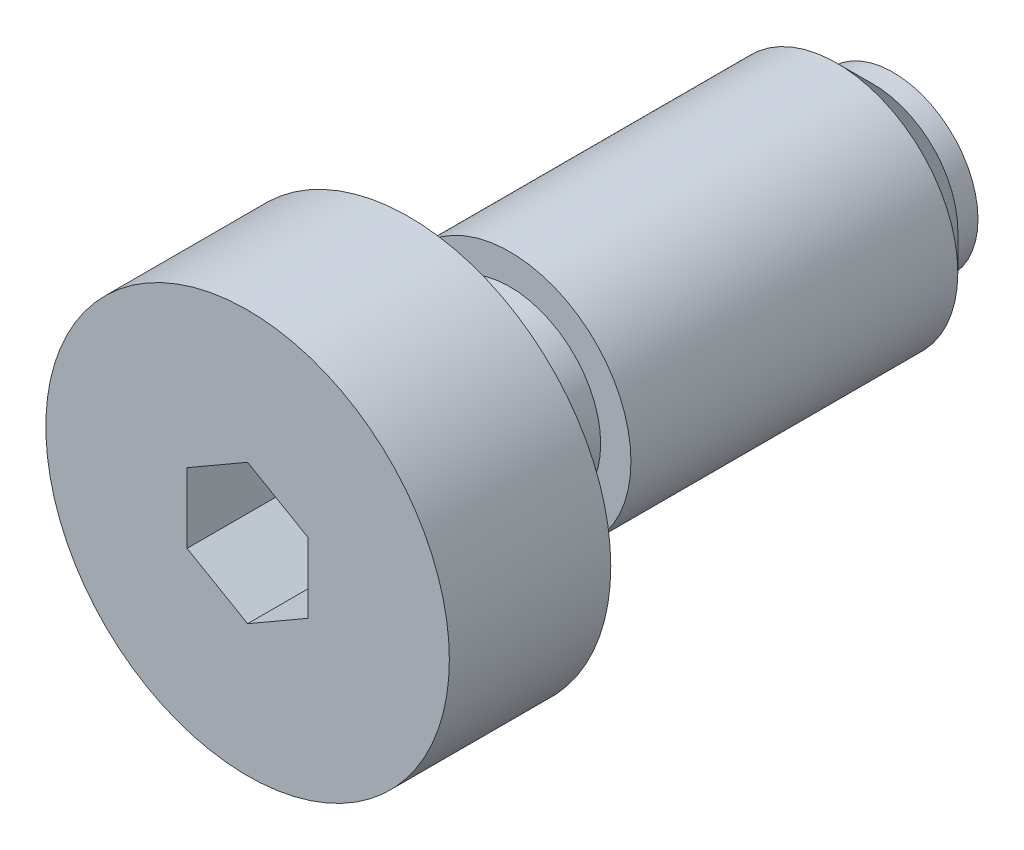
ISO-10303-21;
HEADER;
FILE_DESCRIPTION(('STEP AP214'),'2;1');
FILE_NAME('part.step','',(''),(''),'','','');
FILE_SCHEMA(('AUTOMOTIVE_DESIGN { 1 0 10303 214 1 1 1 1 }'));
ENDSEC;
DATA;
#1=APPLICATION_CONTEXT('core data for automotive mechanical design processes');
#2=APPLICATION_PROTOCOL_DEFINITION('international standard','automotive_design',2000,#1);
#3=PRODUCT_CONTEXT('',#1,'mechanical');
#4=PRODUCT('Part','Part','',(#3));
#5=PRODUCT_RELATED_PRODUCT_CATEGORY('part','',(#4));
#6=PRODUCT_DEFINITION_FORMATION('','',#4);
#7=PRODUCT_DEFINITION_CONTEXT('part definition',#1,'design');
#8=PRODUCT_DEFINITION('design','',#6,#7);
#9=PRODUCT_DEFINITION_SHAPE('','',#8);
#10=(LENGTH_UNIT() NAMED_UNIT(*) SI_UNIT(.MILLI.,.METRE.));
#11=(NAMED_UNIT(*) PLANE_ANGLE_UNIT() SI_UNIT($,.RADIAN.));
#12=(NAMED_UNIT(*) SI_UNIT($,.STERADIAN.) SOLID_ANGLE_UNIT());
#13=UNCERTAINTY_MEASURE_WITH_UNIT(LENGTH_MEASURE(1.E-05),#10,'distance_accuracy_value','');
#14=(GEOMETRIC_REPRESENTATION_CONTEXT(3) GLOBAL_UNCERTAINTY_ASSIGNED_CONTEXT((#13)) GLOBAL_UNIT_ASSIGNED_CONTEXT((#10,
#11,#12)) REPRESENTATION_CONTEXT('',''));
#15=CARTESIAN_POINT('',(0.,0.,0.));
#16=DIRECTION('',(0.,0.,1.));
#17=DIRECTION('',(1.,0.,0.));
#18=AXIS2_PLACEMENT_3D('',#15,#16,#17);
#19=CARTESIAN_POINT('',(0.,0.,15.0318271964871));
#20=DIRECTION('',(0.,0.,1.));
#21=DIRECTION('',(1.,0.,0.));
#22=AXIS2_PLACEMENT_3D('',#19,#20,#21);
#23=CYLINDRICAL_SURFACE('',#22,5.);
#24=CARTESIAN_POINT('',(0.,0.,13.));
#25=DIRECTION('',(0.,0.,1.));
#26=DIRECTION('',(1.,0.,0.));
#27=AXIS2_PLACEMENT_3D('',#24,#25,#26);
#28=CIRCLE('',#27,5.);
#29=CARTESIAN_POINT('',(5.,0.,13.));
#30=VERTEX_POINT('',#29);
#31=EDGE_CURVE('E9',#30,#30,#28,.T.);
#32=ORIENTED_EDGE('',*,*,#31,.T.);
#33=EDGE_LOOP('',(#32));
#34=FACE_BOUND('',#33,.T.);
#35=CARTESIAN_POINT('',(0.,0.,17.));
#36=DIRECTION('',(0.,0.,1.));
#37=DIRECTION('',(1.,0.,0.));
#38=AXIS2_PLACEMENT_3D('',#35,#36,#37);
#39=CIRCLE('',#38,5.);
#40=CARTESIAN_POINT('',(5.,0.,17.));
#41=VERTEX_POINT('',#40);
#42=EDGE_CURVE('E116',#41,#41,#39,.T.);
#43=ORIENTED_EDGE('',*,*,#42,.F.);
#44=EDGE_LOOP('',(#43));
#45=FACE_BOUND('',#44,.T.);
#46=ADVANCED_FACE('F14',(#34,#45),#23,.T.);
#47=CARTESIAN_POINT('',(2.25,0.,13.));
#48=DIRECTION('',(0.,0.,-1.));
#49=DIRECTION('',(-1.,0.,0.));
#50=AXIS2_PLACEMENT_3D('',#47,#48,#49);
#51=PLANE('',#50);
#52=CARTESIAN_POINT('',(0.,0.,13.));
#53=DIRECTION('',(0.,0.,1.));
#54=DIRECTION('',(1.,0.,0.));
#55=AXIS2_PLACEMENT_3D('',#52,#53,#54);
#56=CIRCLE('',#55,2.25);
#57=CARTESIAN_POINT('',(2.25,0.,13.));
#58=VERTEX_POINT('',#57);
#59=EDGE_CURVE('E21',#58,#58,#56,.T.);
#60=ORIENTED_EDGE('',*,*,#59,.T.);
#61=EDGE_LOOP('',(#60));
#62=FACE_BOUND('',#61,.T.);
#63=ORIENTED_EDGE('',*,*,#31,.F.);
#64=EDGE_LOOP('',(#63));
#65=FACE_BOUND('',#64,.T.);
#66=ADVANCED_FACE('F145',(#62,#65),#51,.T.);
#67=CARTESIAN_POINT('',(0.,0.,15.0318271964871));
#68=DIRECTION('',(0.,0.,1.));
#69=DIRECTION('',(1.,0.,0.));
#70=AXIS2_PLACEMENT_3D('',#67,#68,#69);
#71=CYLINDRICAL_SURFACE('',#70,2.25);
#72=CARTESIAN_POINT('',(0.,0.,10.5));
#73=DIRECTION('',(0.,0.,1.));
#74=DIRECTION('',(1.,0.,0.));
#75=AXIS2_PLACEMENT_3D('',#72,#73,#74);
#76=CIRCLE('',#75,2.25);
#77=CARTESIAN_POINT('',(2.25,0.,10.5));
#78=VERTEX_POINT('',#77);
#79=EDGE_CURVE('E140',#78,#78,#76,.T.);
#80=ORIENTED_EDGE('',*,*,#79,.T.);
#81=EDGE_LOOP('',(#80));
#82=FACE_BOUND('',#81,.T.);
#83=ORIENTED_EDGE('',*,*,#59,.F.);
#84=EDGE_LOOP('',(#83));
#85=FACE_BOUND('',#84,.T.);
#86=ADVANCED_FACE('F148',(#82,#85),#71,.T.);
#87=CARTESIAN_POINT('',(2.25,0.,10.5));
#88=DIRECTION('',(0.,0.,1.));
#89=DIRECTION('',(1.,0.,0.));
#90=AXIS2_PLACEMENT_3D('',#87,#88,#89);
#91=PLANE('',#90);
#92=CARTESIAN_POINT('',(0.,0.,10.5));
#93=DIRECTION('',(0.,0.,1.));
#94=DIRECTION('',(1.,0.,0.));
#95=AXIS2_PLACEMENT_3D('',#92,#93,#94);
#96=CIRCLE('',#95,3.);
#97=CARTESIAN_POINT('',(3.,0.,10.5));
#98=VERTEX_POINT('',#97);
#99=EDGE_CURVE('E137',#98,#98,#96,.T.);
#100=ORIENTED_EDGE('',*,*,#99,.T.);
#101=EDGE_LOOP('',(#100));
#102=FACE_BOUND('',#101,.T.);
#103=ORIENTED_EDGE('',*,*,#79,.F.);
#104=EDGE_LOOP('',(#103));
#105=FACE_BOUND('',#104,.T.);
#106=ADVANCED_FACE('F150',(#102,#105),#91,.T.);
#107=CARTESIAN_POINT('',(0.,0.,15.0318271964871));
#108=DIRECTION('',(0.,0.,1.));
#109=DIRECTION('',(1.,0.,0.));
#110=AXIS2_PLACEMENT_3D('',#107,#108,#109);
#111=CYLINDRICAL_SURFACE('',#110,3.);
#112=CARTESIAN_POINT('',(0.,0.,2.4));
#113=DIRECTION('',(0.,0.,1.));
#114=DIRECTION('',(1.,0.,0.));
#115=AXIS2_PLACEMENT_3D('',#112,#113,#114);
#116=CIRCLE('',#115,3.);
#117=CARTESIAN_POINT('',(3.,0.,2.4));
#118=VERTEX_POINT('',#117);
#119=EDGE_CURVE('E134',#118,#118,#116,.T.);
#120=ORIENTED_EDGE('',*,*,#119,.T.);
#121=EDGE_LOOP('',(#120));
#122=FACE_BOUND('',#121,.T.);
#123=ORIENTED_EDGE('',*,*,#99,.F.);
#124=EDGE_LOOP('',(#123));
#125=FACE_BOUND('',#124,.T.);
#126=ADVANCED_FACE('F158',(#122,#125),#111,.T.);
#127=CARTESIAN_POINT('',(0.,0.,2.4));
#128=DIRECTION('',(0.,0.,1.));
#129=DIRECTION('',(1.,0.,0.));
#130=AXIS2_PLACEMENT_3D('',#127,#128,#129);
#131=CONICAL_SURFACE('',#130,3.,0.785398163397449);
#132=CARTESIAN_POINT('',(0.,0.,1.5));
#133=DIRECTION('',(0.,0.,1.));
#134=DIRECTION('',(1.,0.,0.));
#135=AXIS2_PLACEMENT_3D('',#132,#133,#134);
#136=CIRCLE('',#135,2.1);
#137=CARTESIAN_POINT('',(2.1,0.,1.5));
#138=VERTEX_POINT('',#137);
#139=EDGE_CURVE('E131',#138,#138,#136,.T.);
#140=ORIENTED_EDGE('',*,*,#139,.T.);
#141=EDGE_LOOP('',(#140));
#142=FACE_BOUND('',#141,.T.);
#143=ORIENTED_EDGE('',*,*,#119,.F.);
#144=EDGE_LOOP('',(#143));
#145=FACE_BOUND('',#144,.T.);
#146=ADVANCED_FACE('F189',(#142,#145),#131,.T.);
#147=CARTESIAN_POINT('',(0.,0.,15.0318271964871));
#148=DIRECTION('',(0.,0.,1.));
#149=DIRECTION('',(1.,0.,0.));
#150=AXIS2_PLACEMENT_3D('',#147,#148,#149);
#151=CYLINDRICAL_SURFACE('',#150,2.1);
#152=CARTESIAN_POINT('',(0.,0.,1.));
#153=DIRECTION('',(0.,0.,1.));
#154=DIRECTION('',(1.,0.,0.));
#155=AXIS2_PLACEMENT_3D('',#152,#153,#154);
#156=CIRCLE('',#155,2.1);
#157=CARTESIAN_POINT('',(2.1,0.,1.));
#158=VERTEX_POINT('',#157);
#159=EDGE_CURVE('E128',#158,#158,#156,.T.);
#160=ORIENTED_EDGE('',*,*,#159,.T.);
#161=EDGE_LOOP('',(#160));
#162=FACE_BOUND('',#161,.T.);
#163=ORIENTED_EDGE('',*,*,#139,.F.);
#164=EDGE_LOOP('',(#163));
#165=FACE_BOUND('',#164,.T.);
#166=ADVANCED_FACE('F185',(#162,#165),#151,.T.);
#167=CARTESIAN_POINT('',(2.1,0.,1.));
#168=DIRECTION('',(0.,0.,-1.));
#169=DIRECTION('',(-1.,0.,0.));
#170=AXIS2_PLACEMENT_3D('',#167,#168,#169);
#171=PLANE('',#170);
#172=CARTESIAN_POINT('',(0.,0.,1.));
#173=DIRECTION('',(0.,0.,1.));
#174=DIRECTION('',(1.,0.,0.));
#175=AXIS2_PLACEMENT_3D('',#172,#173,#174);
#176=CIRCLE('',#175,1.58113883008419);
#177=CARTESIAN_POINT('',(1.58113883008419,0.,1.));
#178=VERTEX_POINT('',#177);
#179=EDGE_CURVE('E125',#178,#178,#176,.T.);
#180=ORIENTED_EDGE('',*,*,#179,.T.);
#181=EDGE_LOOP('',(#180));
#182=FACE_BOUND('',#181,.T.);
#183=ORIENTED_EDGE('',*,*,#159,.F.);
#184=EDGE_LOOP('',(#183));
#185=FACE_BOUND('',#184,.T.);
#186=ADVANCED_FACE('F178',(#182,#185),#171,.T.);
#187=CARTESIAN_POINT('',(0.,0.,1.75));
#188=DIRECTION('',(0.,0.,1.));
#189=DIRECTION('',(1.,0.,0.));
#190=AXIS2_PLACEMENT_3D('',#187,#188,#189);
#191=SPHERICAL_SURFACE('',#190,1.75);
#192=ORIENTED_EDGE('',*,*,#179,.F.);
#193=EDGE_LOOP('',(#192));
#194=FACE_BOUND('',#193,.T.);
#195=ADVANCED_FACE('F170',(#194),#191,.T.);
#196=CARTESIAN_POINT('',(5.,0.,17.));
#197=DIRECTION('',(0.,0.,1.));
#198=DIRECTION('',(1.,0.,0.));
#199=AXIS2_PLACEMENT_3D('',#196,#197,#198);
#200=PLANE('',#199);
#201=DIRECTION('',(-0.866025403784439,0.5,0.));
#202=VECTOR('',#201,1.);
#203=CARTESIAN_POINT('',(1.5,0.866025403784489,17.));
#204=LINE('',#203,#202);
#205=CARTESIAN_POINT('',(1.5,0.866025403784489,17.));
#206=VERTEX_POINT('',#205);
#207=CARTESIAN_POINT('',(0.,1.73205080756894,17.));
#208=VERTEX_POINT('',#207);
#209=EDGE_CURVE('E28',#206,#208,#204,.T.);
#210=ORIENTED_EDGE('',*,*,#209,.F.);
#211=DIRECTION('',(0.,1.,0.));
#212=VECTOR('',#211,1.);
#213=CARTESIAN_POINT('',(1.5,-0.866025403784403,17.));
#214=LINE('',#213,#212);
#215=CARTESIAN_POINT('',(1.5,-0.866025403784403,17.));
#216=VERTEX_POINT('',#215);
#217=EDGE_CURVE('E98',#216,#206,#214,.T.);
#218=ORIENTED_EDGE('',*,*,#217,.F.);
#219=DIRECTION('',(0.866025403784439,0.5,0.));
#220=VECTOR('',#219,1.);
#221=CARTESIAN_POINT('',(0.,-1.73205080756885,17.));
#222=LINE('',#221,#220);
#223=CARTESIAN_POINT('',(0.,-1.73205080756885,17.));
#224=VERTEX_POINT('',#223);
#225=EDGE_CURVE('E92',#224,#216,#222,.T.);
#226=ORIENTED_EDGE('',*,*,#225,.F.);
#227=DIRECTION('',(0.866025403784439,-0.5,0.));
#228=VECTOR('',#227,1.);
#229=CARTESIAN_POINT('',(-1.5,-0.866025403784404,17.));
#230=LINE('',#229,#228);
#231=CARTESIAN_POINT('',(-1.5,-0.866025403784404,17.));
#232=VERTEX_POINT('',#231);
#233=EDGE_CURVE('E90',#232,#224,#230,.T.);
#234=ORIENTED_EDGE('',*,*,#233,.F.);
#235=DIRECTION('',(0.,-1.,0.));
#236=VECTOR('',#235,1.);
#237=CARTESIAN_POINT('',(-1.5,0.866025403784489,17.));
#238=LINE('',#237,#236);
#239=CARTESIAN_POINT('',(-1.5,0.866025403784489,17.));
#240=VERTEX_POINT('',#239);
#241=EDGE_CURVE('E71',#240,#232,#238,.T.);
#242=ORIENTED_EDGE('',*,*,#241,.F.);
#243=DIRECTION('',(-0.866025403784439,-0.5,0.));
#244=VECTOR('',#243,1.);
#245=CARTESIAN_POINT('',(0.,1.73205080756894,17.));
#246=LINE('',#245,#244);
#247=EDGE_CURVE('E82',#208,#240,#246,.T.);
#248=ORIENTED_EDGE('',*,*,#247,.F.);
#249=EDGE_LOOP('',(#210,#218,#226,#234,#242,#248));
#250=FACE_BOUND('',#249,.T.);
#251=ORIENTED_EDGE('',*,*,#42,.T.);
#252=EDGE_LOOP('',(#251));
#253=FACE_BOUND('',#252,.T.);
#254=ADVANCED_FACE('F86',(#250,#253),#200,.T.);
#255=CARTESIAN_POINT('',(1.5,0.86602540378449,14.));
#256=DIRECTION('',(0.5,0.866025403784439,0.));
#257=DIRECTION('',(0.866025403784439,-0.5,0.));
#258=AXIS2_PLACEMENT_3D('',#255,#256,#257);
#259=PLANE('',#258);
#260=ORIENTED_EDGE('',*,*,#209,.T.);
#261=DIRECTION('',(0.,0.,1.));
#262=VECTOR('',#261,1.);
#263=CARTESIAN_POINT('',(0.,1.73205080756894,14.));
#264=LINE('',#263,#262);
#265=CARTESIAN_POINT('',(0.,1.73205080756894,14.));
#266=VERTEX_POINT('',#265);
#267=EDGE_CURVE('E79',#266,#208,#264,.T.);
#268=ORIENTED_EDGE('',*,*,#267,.F.);
#269=DIRECTION('',(-0.866025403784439,0.5,0.));
#270=VECTOR('',#269,1.);
#271=CARTESIAN_POINT('',(1.5,0.86602540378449,14.));
#272=LINE('',#271,#270);
#273=CARTESIAN_POINT('',(1.5,0.86602540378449,14.));
#274=VERTEX_POINT('',#273);
#275=EDGE_CURVE('E100',#274,#266,#272,.T.);
#276=ORIENTED_EDGE('',*,*,#275,.F.);
#277=DIRECTION('',(0.,0.,1.));
#278=VECTOR('',#277,1.);
#279=CARTESIAN_POINT('',(1.5,0.86602540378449,14.));
#280=LINE('',#279,#278);
#281=EDGE_CURVE('E35',#274,#206,#280,.T.);
#282=ORIENTED_EDGE('',*,*,#281,.T.);
#283=EDGE_LOOP('',(#260,#268,#276,#282));
#284=FACE_BOUND('',#283,.T.);
#285=ADVANCED_FACE('F169',(#284),#259,.F.);
#286=CARTESIAN_POINT('',(1.5,-0.866025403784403,14.));
#287=DIRECTION('',(1.,0.,0.));
#288=DIRECTION('',(0.,0.,1.));
#289=AXIS2_PLACEMENT_3D('',#286,#287,#288);
#290=PLANE('',#289);
#291=ORIENTED_EDGE('',*,*,#217,.T.);
#292=ORIENTED_EDGE('',*,*,#281,.F.);
#293=DIRECTION('',(0.,1.,0.));
#294=VECTOR('',#293,1.);
#295=CARTESIAN_POINT('',(1.5,-0.866025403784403,14.));
#296=LINE('',#295,#294);
#297=CARTESIAN_POINT('',(1.5,-0.866025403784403,14.));
#298=VERTEX_POINT('',#297);
#299=EDGE_CURVE('E112',#298,#274,#296,.T.);
#300=ORIENTED_EDGE('',*,*,#299,.F.);
#301=DIRECTION('',(0.,0.,1.));
#302=VECTOR('',#301,1.);
#303=CARTESIAN_POINT('',(1.5,-0.866025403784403,14.));
#304=LINE('',#303,#302);
#305=EDGE_CURVE('E117',#298,#216,#304,.T.);
#306=ORIENTED_EDGE('',*,*,#305,.T.);
#307=EDGE_LOOP('',(#291,#292,#300,#306));
#308=FACE_BOUND('',#307,.T.);
#309=ADVANCED_FACE('F176',(#308),#290,.F.);
#310=CARTESIAN_POINT('',(0.,-1.73205080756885,14.));
#311=DIRECTION('',(0.5,-0.866025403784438,0.));
#312=DIRECTION('',(-0.866025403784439,-0.5,0.));
#313=AXIS2_PLACEMENT_3D('',#310,#311,#312);
#314=PLANE('',#313);
#315=ORIENTED_EDGE('',*,*,#225,.T.);
#316=ORIENTED_EDGE('',*,*,#305,.F.);
#317=DIRECTION('',(0.866025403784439,0.5,0.));
#318=VECTOR('',#317,1.);
#319=CARTESIAN_POINT('',(0.,-1.73205080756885,14.));
#320=LINE('',#319,#318);
#321=CARTESIAN_POINT('',(0.,-1.73205080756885,14.));
#322=VERTEX_POINT('',#321);
#323=EDGE_CURVE('E109',#322,#298,#320,.T.);
#324=ORIENTED_EDGE('',*,*,#323,.F.);
#325=DIRECTION('',(0.,0.,1.));
#326=VECTOR('',#325,1.);
#327=CARTESIAN_POINT('',(0.,-1.73205080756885,14.));
#328=LINE('',#327,#326);
#329=EDGE_CURVE('E119',#322,#224,#328,.T.);
#330=ORIENTED_EDGE('',*,*,#329,.T.);
#331=EDGE_LOOP('',(#315,#316,#324,#330));
#332=FACE_BOUND('',#331,.T.);
#333=ADVANCED_FACE('F252',(#332),#314,.F.);
#334=CARTESIAN_POINT('',(-1.5,-0.866025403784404,14.));
#335=DIRECTION('',(-0.5,-0.866025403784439,0.));
#336=DIRECTION('',(-0.866025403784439,0.5,0.));
#337=AXIS2_PLACEMENT_3D('',#334,#335,#336);
#338=PLANE('',#337);
#339=ORIENTED_EDGE('',*,*,#233,.T.);
#340=ORIENTED_EDGE('',*,*,#329,.F.);
#341=DIRECTION('',(0.866025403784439,-0.5,0.));
#342=VECTOR('',#341,1.);
#343=CARTESIAN_POINT('',(-1.5,-0.866025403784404,14.));
#344=LINE('',#343,#342);
#345=CARTESIAN_POINT('',(-1.5,-0.866025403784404,14.));
#346=VERTEX_POINT('',#345);
#347=EDGE_CURVE('E106',#346,#322,#344,.T.);
#348=ORIENTED_EDGE('',*,*,#347,.F.);
#349=DIRECTION('',(0.,0.,1.));
#350=VECTOR('',#349,1.);
#351=CARTESIAN_POINT('',(-1.5,-0.866025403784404,14.));
#352=LINE('',#351,#350);
#353=EDGE_CURVE('E78',#346,#232,#352,.T.);
#354=ORIENTED_EDGE('',*,*,#353,.T.);
#355=EDGE_LOOP('',(#339,#340,#348,#354));
#356=FACE_BOUND('',#355,.T.);
#357=ADVANCED_FACE('F261',(#356),#338,.F.);
#358=CARTESIAN_POINT('',(-1.5,0.86602540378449,14.));
#359=DIRECTION('',(-1.,0.,0.));
#360=DIRECTION('',(0.,0.,-1.));
#361=AXIS2_PLACEMENT_3D('',#358,#359,#360);
#362=PLANE('',#361);
#363=ORIENTED_EDGE('',*,*,#241,.T.);
#364=ORIENTED_EDGE('',*,*,#353,.F.);
#365=DIRECTION('',(0.,-1.,0.));
#366=VECTOR('',#365,1.);
#367=CARTESIAN_POINT('',(-1.5,0.86602540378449,14.));
#368=LINE('',#367,#366);
#369=CARTESIAN_POINT('',(-1.5,0.86602540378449,14.));
#370=VERTEX_POINT('',#369);
#371=EDGE_CURVE('E74',#370,#346,#368,.T.);
#372=ORIENTED_EDGE('',*,*,#371,.F.);
#373=DIRECTION('',(0.,0.,1.));
#374=VECTOR('',#373,1.);
#375=CARTESIAN_POINT('',(-1.5,0.86602540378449,14.));
#376=LINE('',#375,#374);
#377=EDGE_CURVE('E67',#370,#240,#376,.T.);
#378=ORIENTED_EDGE('',*,*,#377,.T.);
#379=EDGE_LOOP('',(#363,#364,#372,#378));
#380=FACE_BOUND('',#379,.T.);
#381=ADVANCED_FACE('F69',(#380),#362,.F.);
#382=CARTESIAN_POINT('',(0.,1.73205080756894,14.));
#383=DIRECTION('',(-0.5,0.866025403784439,0.));
#384=DIRECTION('',(0.866025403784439,0.5,0.));
#385=AXIS2_PLACEMENT_3D('',#382,#383,#384);
#386=PLANE('',#385);
#387=ORIENTED_EDGE('',*,*,#247,.T.);
#388=ORIENTED_EDGE('',*,*,#377,.F.);
#389=DIRECTION('',(-0.866025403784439,-0.5,0.));
#390=VECTOR('',#389,1.);
#391=CARTESIAN_POINT('',(0.,1.73205080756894,14.));
#392=LINE('',#391,#390);
#393=EDGE_CURVE('E103',#266,#370,#392,.T.);
#394=ORIENTED_EDGE('',*,*,#393,.F.);
#395=ORIENTED_EDGE('',*,*,#267,.T.);
#396=EDGE_LOOP('',(#387,#388,#394,#395));
#397=FACE_BOUND('',#396,.T.);
#398=ADVANCED_FACE('F83',(#397),#386,.F.);
#399=CARTESIAN_POINT('',(0.,1.73205080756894,14.));
#400=DIRECTION('',(0.,0.,1.));
#401=DIRECTION('',(0.,-1.,0.));
#402=AXIS2_PLACEMENT_3D('',#399,#400,#401);
#403=PLANE('',#402);
#404=ORIENTED_EDGE('',*,*,#275,.T.);
#405=ORIENTED_EDGE('',*,*,#393,.T.);
#406=ORIENTED_EDGE('',*,*,#371,.T.);
#407=ORIENTED_EDGE('',*,*,#347,.T.);
#408=ORIENTED_EDGE('',*,*,#323,.T.);
#409=ORIENTED_EDGE('',*,*,#299,.T.);
#410=EDGE_LOOP('',(#404,#405,#406,#407,#408,#409));
#411=FACE_BOUND('',#410,.T.);
#412=ADVANCED_FACE('F288',(#411),#403,.T.);
#413=CLOSED_SHELL('',(#46,#66,#86,#106,#126,#146,#166,#186,#195,#254,#285,#309,#333,#357,#381,
#398,#412));
#414=MANIFOLD_SOLID_BREP('B1',#413);
#415=ADVANCED_BREP_SHAPE_REPRESENTATION('',(#18,#414),#14);
#416=SHAPE_DEFINITION_REPRESENTATION(#9,#415);
ENDSEC;
END-ISO-10303-21;
